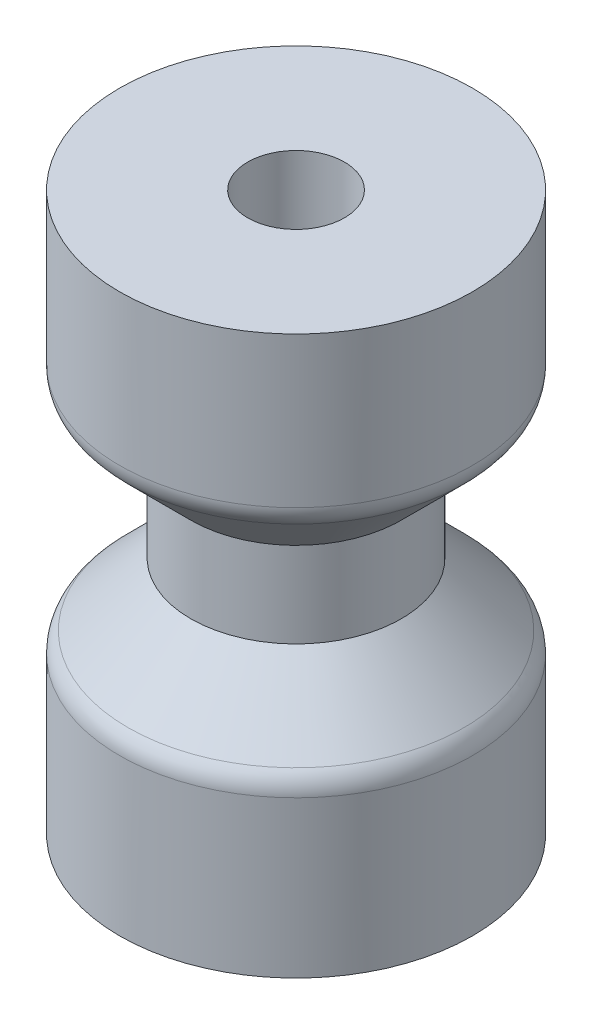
ISO-10303-21;
HEADER;
FILE_DESCRIPTION(('STEP AP214'),'2;1');
FILE_NAME('part.step','',(''),(''),'','','');
FILE_SCHEMA(('AUTOMOTIVE_DESIGN { 1 0 10303 214 1 1 1 1 }'));
ENDSEC;
DATA;
#1=APPLICATION_CONTEXT('core data for automotive mechanical design processes');
#2=APPLICATION_PROTOCOL_DEFINITION('international standard','automotive_design',2000,#1);
#3=PRODUCT_CONTEXT('',#1,'mechanical');
#4=PRODUCT('Part','Part','',(#3));
#5=PRODUCT_RELATED_PRODUCT_CATEGORY('part','',(#4));
#6=PRODUCT_DEFINITION_FORMATION('','',#4);
#7=PRODUCT_DEFINITION_CONTEXT('part definition',#1,'design');
#8=PRODUCT_DEFINITION('design','',#6,#7);
#9=PRODUCT_DEFINITION_SHAPE('','',#8);
#10=(LENGTH_UNIT() NAMED_UNIT(*) SI_UNIT(.MILLI.,.METRE.));
#11=(NAMED_UNIT(*) PLANE_ANGLE_UNIT() SI_UNIT($,.RADIAN.));
#12=(NAMED_UNIT(*) SI_UNIT($,.STERADIAN.) SOLID_ANGLE_UNIT());
#13=UNCERTAINTY_MEASURE_WITH_UNIT(LENGTH_MEASURE(1.E-05),#10,'distance_accuracy_value','');
#14=(GEOMETRIC_REPRESENTATION_CONTEXT(3) GLOBAL_UNCERTAINTY_ASSIGNED_CONTEXT((#13)) GLOBAL_UNIT_ASSIGNED_CONTEXT((#10,
#11,#12)) REPRESENTATION_CONTEXT('',''));
#15=CARTESIAN_POINT('',(0.,0.,0.));
#16=DIRECTION('',(0.,0.,1.));
#17=DIRECTION('',(1.,0.,0.));
#18=AXIS2_PLACEMENT_3D('',#15,#16,#17);
#19=CARTESIAN_POINT('',(0.,19.6,0.));
#20=DIRECTION('',(0.,-1.,0.));
#21=DIRECTION('',(0.,0.,-1.));
#22=AXIS2_PLACEMENT_3D('',#19,#20,#21);
#23=CYLINDRICAL_SURFACE('',#22,6.2);
#24=CARTESIAN_POINT('',(0.,14.3142135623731,0.));
#25=DIRECTION('',(0.,-1.,0.));
#26=DIRECTION('',(0.,0.,-1.));
#27=AXIS2_PLACEMENT_3D('',#24,#25,#26);
#28=CIRCLE('',#27,6.2);
#29=CARTESIAN_POINT('',(0.,14.3142135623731,-6.2));
#30=VERTEX_POINT('',#29);
#31=EDGE_CURVE('E41',#30,#30,#28,.F.);
#32=ORIENTED_EDGE('',*,*,#31,.T.);
#33=EDGE_LOOP('',(#32));
#34=FACE_BOUND('',#33,.T.);
#35=CARTESIAN_POINT('',(0.,19.6,0.));
#36=DIRECTION('',(0.,1.,0.));
#37=DIRECTION('',(0.,0.,1.));
#38=AXIS2_PLACEMENT_3D('',#35,#36,#37);
#39=CIRCLE('',#38,6.2);
#40=CARTESIAN_POINT('',(0.,19.6,6.2));
#41=VERTEX_POINT('',#40);
#42=EDGE_CURVE('E54',#41,#41,#39,.T.);
#43=ORIENTED_EDGE('',*,*,#42,.F.);
#44=EDGE_LOOP('',(#43));
#45=FACE_BOUND('',#44,.T.);
#46=ADVANCED_FACE('F34',(#34,#45),#23,.T.);
#47=CARTESIAN_POINT('',(0.,19.6,0.));
#48=DIRECTION('',(0.,1.,0.));
#49=DIRECTION('',(0.,0.,1.));
#50=AXIS2_PLACEMENT_3D('',#47,#48,#49);
#51=PLANE('',#50);
#52=ORIENTED_EDGE('',*,*,#42,.T.);
#53=EDGE_LOOP('',(#52));
#54=FACE_BOUND('',#53,.T.);
#55=CARTESIAN_POINT('',(0.,19.6,0.));
#56=DIRECTION('',(0.,1.,0.));
#57=DIRECTION('',(0.,0.,1.));
#58=AXIS2_PLACEMENT_3D('',#55,#56,#57);
#59=CIRCLE('',#58,1.7);
#60=CARTESIAN_POINT('',(0.,19.6,1.7));
#61=VERTEX_POINT('',#60);
#62=EDGE_CURVE('E58',#61,#61,#59,.T.);
#63=ORIENTED_EDGE('',*,*,#62,.F.);
#64=EDGE_LOOP('',(#63));
#65=FACE_BOUND('',#64,.T.);
#66=ADVANCED_FACE('F89',(#54,#65),#51,.T.);
#67=CARTESIAN_POINT('',(0.,0.,0.));
#68=DIRECTION('',(0.,1.,0.));
#69=DIRECTION('',(0.,0.,1.));
#70=AXIS2_PLACEMENT_3D('',#67,#68,#69);
#71=PLANE('',#70);
#72=CARTESIAN_POINT('',(0.,0.,0.));
#73=DIRECTION('',(0.,1.,0.));
#74=DIRECTION('',(0.,0.,1.));
#75=AXIS2_PLACEMENT_3D('',#72,#73,#74);
#76=CIRCLE('',#75,6.2);
#77=CARTESIAN_POINT('',(0.,0.,6.2));
#78=VERTEX_POINT('',#77);
#79=EDGE_CURVE('E55',#78,#78,#76,.T.);
#80=ORIENTED_EDGE('',*,*,#79,.F.);
#81=EDGE_LOOP('',(#80));
#82=FACE_BOUND('',#81,.T.);
#83=CARTESIAN_POINT('',(0.,0.,0.));
#84=DIRECTION('',(0.,1.,0.));
#85=DIRECTION('',(0.,0.,1.));
#86=AXIS2_PLACEMENT_3D('',#83,#84,#85);
#87=CIRCLE('',#86,1.7);
#88=CARTESIAN_POINT('',(0.,0.,1.7));
#89=VERTEX_POINT('',#88);
#90=EDGE_CURVE('E61',#89,#89,#87,.T.);
#91=ORIENTED_EDGE('',*,*,#90,.T.);
#92=EDGE_LOOP('',(#91));
#93=FACE_BOUND('',#92,.T.);
#94=ADVANCED_FACE('F95',(#82,#93),#71,.F.);
#95=CARTESIAN_POINT('',(0.,5.48578643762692,0.));
#96=DIRECTION('',(0.,-1.,0.));
#97=DIRECTION('',(0.,0.,-1.));
#98=AXIS2_PLACEMENT_3D('',#95,#96,#97);
#99=CIRCLE('',#98,6.2);
#100=CARTESIAN_POINT('',(0.,5.48578643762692,-6.2));
#101=VERTEX_POINT('',#100);
#102=EDGE_CURVE('E45',#101,#101,#99,.T.);
#103=ORIENTED_EDGE('',*,*,#102,.T.);
#104=EDGE_LOOP('',(#103));
#105=FACE_BOUND('',#104,.T.);
#106=ORIENTED_EDGE('',*,*,#79,.T.);
#107=EDGE_LOOP('',(#106));
#108=FACE_BOUND('',#107,.T.);
#109=ADVANCED_FACE('F91',(#105,#108),#23,.T.);
#110=CARTESIAN_POINT('',(0.,19.6,0.));
#111=DIRECTION('',(0.,-1.,0.));
#112=DIRECTION('',(0.,0.,-1.));
#113=AXIS2_PLACEMENT_3D('',#110,#111,#112);
#114=CYLINDRICAL_SURFACE('',#113,1.7);
#115=ORIENTED_EDGE('',*,*,#62,.T.);
#116=EDGE_LOOP('',(#115));
#117=FACE_BOUND('',#116,.T.);
#118=ORIENTED_EDGE('',*,*,#90,.F.);
#119=EDGE_LOOP('',(#118));
#120=FACE_BOUND('',#119,.T.);
#121=ADVANCED_FACE('F101',(#117,#120),#114,.F.);
#122=CARTESIAN_POINT('',(0.,11.4,0.));
#123=DIRECTION('',(0.,1.,0.));
#124=DIRECTION('',(0.,0.,1.));
#125=AXIS2_PLACEMENT_3D('',#122,#123,#124);
#126=CONICAL_SURFACE('',#125,3.7,0.785398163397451);
#127=CARTESIAN_POINT('',(0.,13.6071067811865,0.));
#128=DIRECTION('',(0.,-1.,0.));
#129=DIRECTION('',(0.,0.,-1.));
#130=AXIS2_PLACEMENT_3D('',#127,#128,#129);
#131=CIRCLE('',#130,5.90710678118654);
#132=CARTESIAN_POINT('',(0.,13.6071067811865,-5.90710678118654));
#133=VERTEX_POINT('',#132);
#134=EDGE_CURVE('E10',#133,#133,#131,.T.);
#135=ORIENTED_EDGE('',*,*,#134,.T.);
#136=EDGE_LOOP('',(#135));
#137=FACE_BOUND('',#136,.T.);
#138=CARTESIAN_POINT('',(0.,11.4,0.));
#139=DIRECTION('',(0.,1.,0.));
#140=DIRECTION('',(0.,0.,1.));
#141=AXIS2_PLACEMENT_3D('',#138,#139,#140);
#142=CIRCLE('',#141,3.7);
#143=CARTESIAN_POINT('',(0.,11.4,3.7));
#144=VERTEX_POINT('',#143);
#145=EDGE_CURVE('E64',#144,#144,#142,.T.);
#146=ORIENTED_EDGE('',*,*,#145,.T.);
#147=EDGE_LOOP('',(#146));
#148=FACE_BOUND('',#147,.T.);
#149=ADVANCED_FACE('F85',(#137,#148),#126,.T.);
#150=CARTESIAN_POINT('',(0.,33.0804676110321,0.));
#151=DIRECTION('',(0.,1.,0.));
#152=DIRECTION('',(0.,0.,1.));
#153=AXIS2_PLACEMENT_3D('',#150,#151,#152);
#154=CYLINDRICAL_SURFACE('',#153,3.7);
#155=ORIENTED_EDGE('',*,*,#145,.F.);
#156=EDGE_LOOP('',(#155));
#157=FACE_BOUND('',#156,.T.);
#158=CARTESIAN_POINT('',(0.,8.40000000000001,0.));
#159=DIRECTION('',(0.,1.,0.));
#160=DIRECTION('',(0.,0.,1.));
#161=AXIS2_PLACEMENT_3D('',#158,#159,#160);
#162=CIRCLE('',#161,3.7);
#163=CARTESIAN_POINT('',(0.,8.40000000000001,3.7));
#164=VERTEX_POINT('',#163);
#165=EDGE_CURVE('E69',#164,#164,#162,.T.);
#166=ORIENTED_EDGE('',*,*,#165,.T.);
#167=EDGE_LOOP('',(#166));
#168=FACE_BOUND('',#167,.T.);
#169=ADVANCED_FACE('F73',(#157,#168),#154,.T.);
#170=CARTESIAN_POINT('',(0.,5.90000000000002,0.));
#171=DIRECTION('',(0.,-1.,0.));
#172=DIRECTION('',(0.,0.,-1.));
#173=AXIS2_PLACEMENT_3D('',#170,#171,#172);
#174=CONICAL_SURFACE('',#173,6.2,0.78539816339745);
#175=CARTESIAN_POINT('',(0.,6.19289321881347,0.));
#176=DIRECTION('',(0.,1.,0.));
#177=DIRECTION('',(0.,0.,1.));
#178=AXIS2_PLACEMENT_3D('',#175,#176,#177);
#179=CIRCLE('',#178,5.90710678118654);
#180=CARTESIAN_POINT('',(0.,6.19289321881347,5.90710678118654));
#181=VERTEX_POINT('',#180);
#182=EDGE_CURVE('E49',#181,#181,#179,.T.);
#183=ORIENTED_EDGE('',*,*,#182,.T.);
#184=EDGE_LOOP('',(#183));
#185=FACE_BOUND('',#184,.T.);
#186=ORIENTED_EDGE('',*,*,#165,.F.);
#187=EDGE_LOOP('',(#186));
#188=FACE_BOUND('',#187,.T.);
#189=ADVANCED_FACE('F75',(#185,#188),#174,.T.);
#190=CARTESIAN_POINT('',(0.,5.48578643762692,0.));
#191=DIRECTION('',(0.,-1.,0.));
#192=DIRECTION('',(0.,0.,-1.));
#193=AXIS2_PLACEMENT_3D('',#190,#191,#192);
#194=TOROIDAL_SURFACE('',#193,5.2,1.);
#195=ORIENTED_EDGE('',*,*,#102,.F.);
#196=EDGE_LOOP('',(#195));
#197=FACE_BOUND('',#196,.T.);
#198=ORIENTED_EDGE('',*,*,#182,.F.);
#199=EDGE_LOOP('',(#198));
#200=FACE_BOUND('',#199,.T.);
#201=ADVANCED_FACE('F77',(#197,#200),#194,.T.);
#202=CARTESIAN_POINT('',(0.,14.3142135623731,0.));
#203=DIRECTION('',(0.,-1.,0.));
#204=DIRECTION('',(0.,0.,-1.));
#205=AXIS2_PLACEMENT_3D('',#202,#203,#204);
#206=TOROIDAL_SURFACE('',#205,5.2,1.);
#207=ORIENTED_EDGE('',*,*,#134,.F.);
#208=EDGE_LOOP('',(#207));
#209=FACE_BOUND('',#208,.T.);
#210=ORIENTED_EDGE('',*,*,#31,.F.);
#211=EDGE_LOOP('',(#210));
#212=FACE_BOUND('',#211,.T.);
#213=ADVANCED_FACE('F36',(#209,#212),#206,.T.);
#214=CLOSED_SHELL('',(#46,#66,#94,#109,#121,#149,#169,#189,#201,#213));
#215=MANIFOLD_SOLID_BREP('B2',#214);
#216=ADVANCED_BREP_SHAPE_REPRESENTATION('',(#18,#215),#14);
#217=SHAPE_DEFINITION_REPRESENTATION(#9,#216);
ENDSEC;
END-ISO-10303-21;
